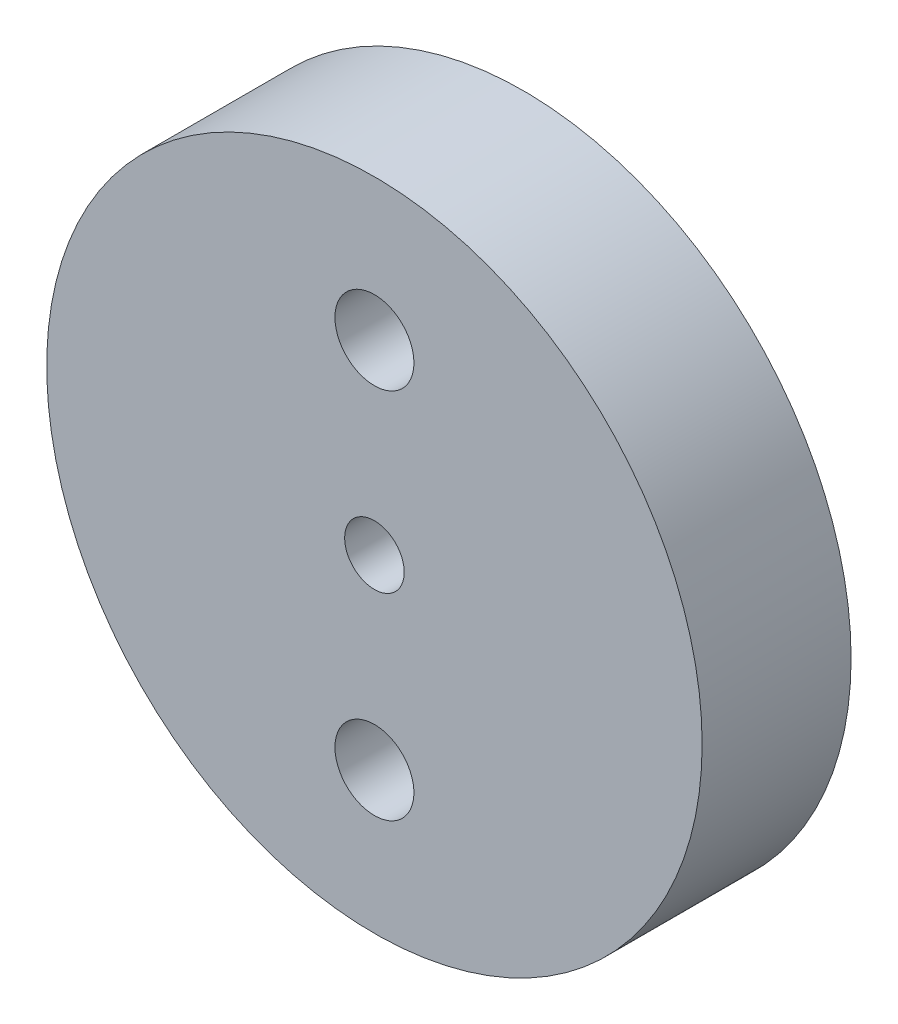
from build123d import *

# Parameters (mm, degrees)
SKETCH1_R                      = 22
BOSS_EXTRUDE1_DEPTH            = 10
SKETCH2_R                      = 2
CUT_EXTRUDE1_DEPTH             = 33.680269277
CBORE_FOR_M5_SHCS1_D           = 5.3
CBORE_FOR_M5_SHCS1_CBORE_D     = 10
CBORE_FOR_M5_SHCS1_CBORE_DEPTH = 6
CIRPATTERN1_COUNT              = 2
CIRPATTERN2_COUNT              = 8


with BuildPart() as part:
    # Sketch1 → Boss-Extrude1 (new body)
    with BuildSketch(Plane.XY):
        Circle(SKETCH1_R)
    extrude(amount=BOSS_EXTRUDE1_DEPTH)

    # Sketch2 → Cut-Extrude1 (cut, through all)
    with BuildSketch(Plane(origin=(0, 0, 0), x_dir=(-1, 0, 0), z_dir=(0, 0, -1))):
        Circle(SKETCH2_R)
    extrude(amount=-CUT_EXTRUDE1_DEPTH, mode=Mode.SUBTRACT)

    # CBORE for M5 SHCS1 (through all)
    with Locations(Plane(origin=(0, 0, 0), x_dir=(-1, 0, 0), z_dir=(0, 0, -1))):
        with Locations((0, 12.495)):
            cbore_for_m5_shcs1 = CounterBoreHole(CBORE_FOR_M5_SHCS1_D / 2, CBORE_FOR_M5_SHCS1_CBORE_D / 2, CBORE_FOR_M5_SHCS1_CBORE_DEPTH)

    # CirPattern1: CBORE for M5 SHCS1 ×2 about axis
    cirpattern1_axis = Axis((0, 0, 0), (0, 0, 1))
    for i in range(1, CIRPATTERN1_COUNT):
        add(cbore_for_m5_shcs1.rotate(cirpattern1_axis, i * 360 / CIRPATTERN1_COUNT), mode=Mode.SUBTRACT)

    # Sketch7 → M3x0.5 Tapped Hole1 (revolve, cut)
    with BuildSketch(Plane(origin=(7.27, 17.554119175, 0), x_dir=(0, 1, 0), z_dir=(1, 0, 0))):
        Polygon((0, 0), (0, 9.251075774), (1.25, 8.5), (1.25, 0), align=None)
    m3x0_5_tapped_hole1 = revolve(axis=Axis((7.27, 17.554119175, -6.35), (0, 0, 1)), mode=Mode.SUBTRACT)

    # CirPattern2: M3x0.5 Tapped Hole1 ×8 about axis
    cirpattern2_axis = Axis((0, 0, 0), (0, 0, 1))
    for i in range(1, CIRPATTERN2_COUNT):
        add(m3x0_5_tapped_hole1.rotate(cirpattern2_axis, i * 360 / CIRPATTERN2_COUNT), mode=Mode.SUBTRACT)


solid = part.part
